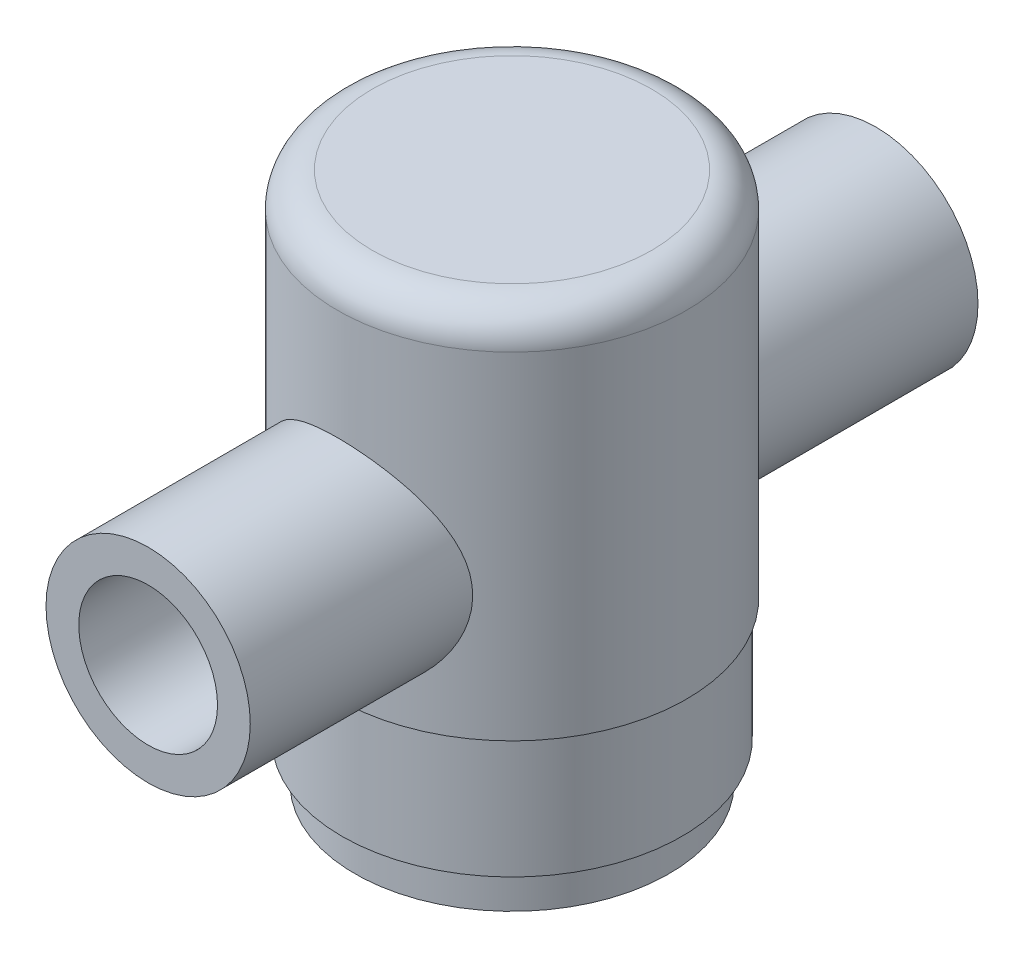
from build123d import *

# Parameters (mm, degrees)
FILLET1_R           = 1.5875
SKETCH2_R           = 4.6736
BOSS_EXTRUDE1_DEPTH = 16.6497
SKETCH3_R           = 0.79375
CUT_EXTRUDE1_DEPTH  = 46.356713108
SKETCH5_R           = 3.175
CUT_EXTRUDE3_DEPTH  = 8.128
CUT_EXTRUDE4_START  = -8.128
SKETCH6_R           = 3.175
CUT_EXTRUDE4_DEPTH  = 8.128


with BuildPart() as part:
    # Sketch1 → Revolve1 (revolve)
    with BuildSketch(Plane.XY, mode=Mode.PRIVATE) as revolve1_sk:
        Polygon((-3.175, 5.4356), (-3.175, 27.6479), (0, 27.6479), (0, 29.7434), (-7.98195, 29.7434), (-7.98195, 12.7508), (-7.777774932, 12.7508), (-7.777774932, 7.2136), (-7.1882, 7.2136), (-7.1882, 5.4356), align=None)
    revolve(revolve1_sk.sketch.rotate(Axis((0, 0, 0), (0, 1, 0)), 270), axis=Axis((0, 0, 0), (0, 1, 0)))

    # Fillet1
    fillet1_edges = [part.edges().sort_by_distance(p)[0] for p in [
        (0, 29.7434, 7.98195),
    ]]
    fillet(fillet1_edges, radius=FILLET1_R)

    # Sketch2 → Boss-Extrude1 (add, symmetric)
    with BuildSketch(Plane.XY):
        with Locations(Location((0, 18.4404, 0), (0, 0, 180))):
            Circle(SKETCH2_R)
    extrude(amount=BOSS_EXTRUDE1_DEPTH, both=True)

    # Sketch3 → Cut-Extrude1 (cut, through all)
    with BuildSketch(Plane.XY.offset(16.6497)):
        with Locations((0, 18.4404)):
            Circle(SKETCH3_R)
    extrude(amount=-CUT_EXTRUDE1_DEPTH, mode=Mode.SUBTRACT)

    # Sketch5 → Cut-Extrude3 (cut)
    with BuildSketch(Plane.XY.offset(16.6497)):
        with Locations((0, 18.4404)):
            Circle(SKETCH5_R)
    extrude(amount=-CUT_EXTRUDE3_DEPTH, mode=Mode.SUBTRACT)

    # Sketch6 → Cut-Extrude4 (cut)
    with BuildSketch(Plane(origin=(0, 0, -16.6497), x_dir=(-1, 0, 0), z_dir=(0, 0, -1)).offset(CUT_EXTRUDE4_START)):
        with Locations(Location((0, 18.4404, 0), (0, 0, 180))):
            Circle(SKETCH6_R)
    extrude(amount=CUT_EXTRUDE4_DEPTH, mode=Mode.SUBTRACT)


solid = part.part
